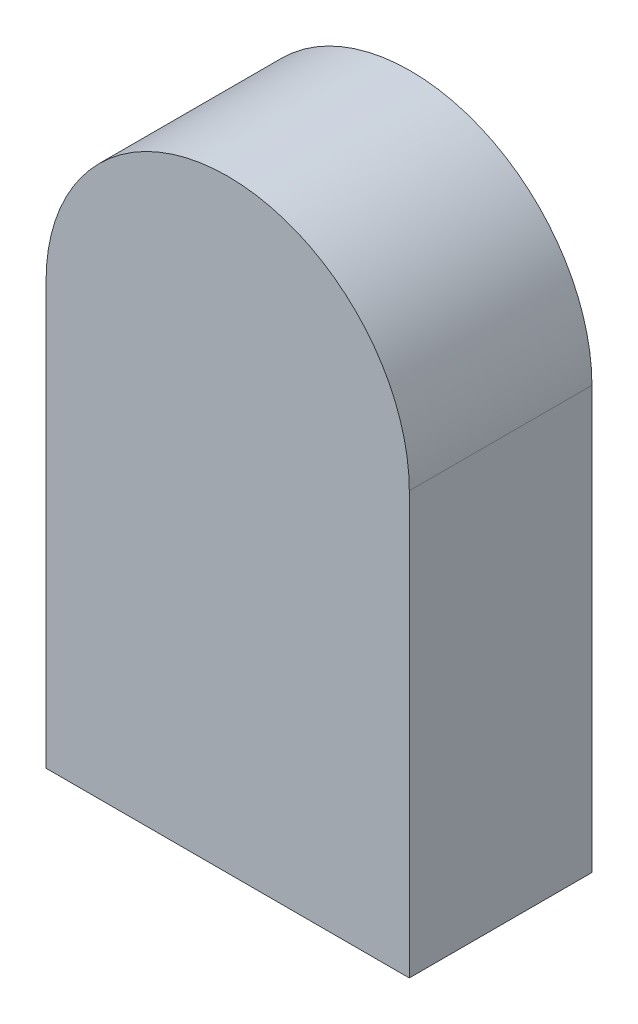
from build123d import *

# Parameters (mm, degrees)
EXTRUDE1_DEPTH = 26.869737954


with BuildPart() as part:
    # Sketch1 → Extrude1 (new body)
    with BuildSketch(Plane.XY):
        with BuildLine():
            Line((0, 62.076859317), (0, 0))
            Line((0, 0), (53.437296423, 0))
            Line((53.437296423, 0), (53.437296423, 62.076859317))
            ThreePointArc((53.437296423, 62.076859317), (26.718648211, 88.795507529), (0, 62.076859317))
        make_face()
    extrude(amount=EXTRUDE1_DEPTH)


solid = part.part
